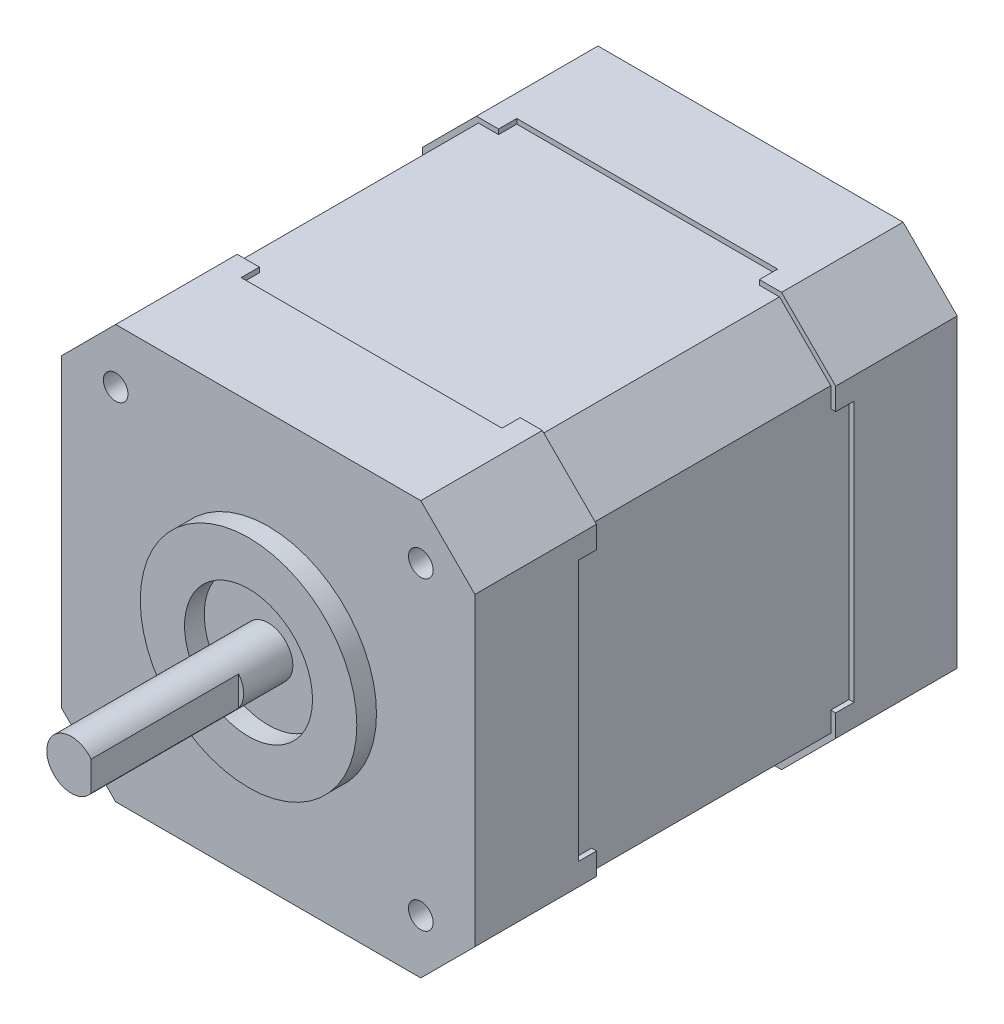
from build123d import *

# Parameters (mm, degrees)
EXTRUDE_1_DEPTH        = 49
SKETCH_2_R             = 11
SKETCH_2_R_2           = 6.5
EXTRUDE_2_DEPTH        = 2
SKETCH_3_R             = 2.5
EXTRUDE_3_DEPTH        = 20
CUT_EXTRUDE_START      = -15
CUT_EXTRUDE_1_DEPTH    = 15
SKETCH_6_W             = 24.3
SKETCH_6_H             = 0.5
SKETCH_7_W             = 26.5
SKETCH_7_H             = 28
CUT_EXTRUDE_2_DEPTH    = 0.5
SKETCH_8_W             = 28
SKETCH_8_H             = 26.5
CUT_EXTRUDE_3_DEPTH    = 0.5
SKETCH_9_W             = 26.5
SKETCH_9_H             = 28
CUT_EXTRUDE_4_DEPTH    = 0.5
SKETCH_10_W            = 28
SKETCH_10_H            = 26.5
CUT_EXTRUDE_5_DEPTH    = 0.5
HOLE_WIZARD_M3_1_D     = 2.5
HOLE_WIZARD_M3_1_DEPTH = 4.5
HOLE_WIZARD_M3_1_TIP   = 0.751075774
EXTRUDE_START          = 15
SKETCH_13_R            = 2.5
EXTRUDE_4_DEPTH        = 15
CHAMFER_1_SIZE         = 0.5


with BuildPart() as part:
    # Sketch 1 → Extrude 1 (new body)
    with BuildSketch(Plane.XY):
        Polygon((-21, 15.5), (-15.5, 21), (15.5, 21), (21, 15.5), (21, -15.5), (15.5, -21), (-15.5, -21), (-21, -15.5), align=None)
    extrude(amount=-EXTRUDE_1_DEPTH)

    # Sketch 2 → Extrude 2 (add)
    with BuildSketch(Plane.XY):
        with Locations(Location((0, 0, 0), (0, 0, 180))):
            Circle(SKETCH_2_R)
        Circle(SKETCH_2_R_2, mode=Mode.SUBTRACT)
    extrude(amount=EXTRUDE_2_DEPTH)

    # Sketch 3 → Extrude 3 (add)
    with BuildSketch(Plane.XY):
        with Locations(Location((0, 0, 0), (0, 0, 180))):
            Circle(SKETCH_3_R)
    extrude(amount=EXTRUDE_3_DEPTH)

    # Sketch 4 → Cut-Extrude 1 (cut)
    with BuildSketch(Plane.XY.offset(20).offset(CUT_EXTRUDE_START)):
        with BuildLine():
            Line((2, 1.5), (2, -1.5))
            ThreePointArc((2, -1.5), (2.5, 0), (2, 1.5))
        make_face()
    extrude(amount=CUT_EXTRUDE_1_DEPTH, mode=Mode.SUBTRACT)

    # Sweep 1: sweep along a path in Sketch 5
    with BuildLine(Plane.XY.offset(-12.35)) as sweep_1_path:
        Line((15.5, 21), (-15.5, 21))
        Line((-15.5, 21), (-21, 15.5))
        Line((-21, 15.5), (-21, -15.5))
        Line((-21, -15.5), (-15.5, -21))
        Line((-15.5, -21), (15.5, -21))
        Line((15.5, -21), (21, -15.5))
        Line((21, -15.5), (21, 15.5))
        Line((21, 15.5), (15.5, 21))
    # Sketch 6 → Sweep 1 (sweep, cut)
    with BuildSketch(Plane(origin=(0, 0, 0), x_dir=(0, 0, -1), z_dir=(1, 0, 0))):
        with Locations((24.5, 20.75)):
            Rectangle(SKETCH_6_W, SKETCH_6_H)
    sweep(path=sweep_1_path.line, transition=Transition.RIGHT, mode=Mode.SUBTRACT)

    # Sketch 7 → Cut-Extrude 2 (cut)
    with BuildSketch(Plane(origin=(0, 21, 0), x_dir=(1, 0, 0), z_dir=(0, 1, 0))):
        with Locations((0, 24.5)):
            Rectangle(SKETCH_7_W, SKETCH_7_H)
    extrude(amount=-CUT_EXTRUDE_2_DEPTH, mode=Mode.SUBTRACT)

    # Sketch 8 → Cut-Extrude 3 (cut)
    with BuildSketch(Plane(origin=(21, 0, 0), x_dir=(0, 0, -1), z_dir=(1, 0, 0))):
        with Locations((24.5, 0)):
            Rectangle(SKETCH_8_W, SKETCH_8_H)
    extrude(amount=-CUT_EXTRUDE_3_DEPTH, mode=Mode.SUBTRACT)

    # Sketch 9 → Cut-Extrude 4 (cut)
    with BuildSketch(Plane.XZ.offset(21)):
        with Locations((0, -24.5)):
            Rectangle(SKETCH_9_W, SKETCH_9_H)
    extrude(amount=-CUT_EXTRUDE_4_DEPTH, mode=Mode.SUBTRACT)

    # Sketch 10 → Cut-Extrude 5 (cut)
    with BuildSketch(Plane.ZY.offset(21)):
        with Locations((-24.5, 0)):
            Rectangle(SKETCH_10_W, SKETCH_10_H)
    extrude(amount=-CUT_EXTRUDE_5_DEPTH, mode=Mode.SUBTRACT)

    # Hole Wizard M3 _1
    with Locations(Plane.XY):
        with Locations((-15.5, 15.5), (15.5, 15.5), (15.5, -15.5), (-15.5, -15.5)):
            Hole(HOLE_WIZARD_M3_1_D / 2, depth=HOLE_WIZARD_M3_1_DEPTH)
            with Locations((0, 0, -(HOLE_WIZARD_M3_1_DEPTH + HOLE_WIZARD_M3_1_TIP / 2))):  # 118° drill point
                Cone(0, HOLE_WIZARD_M3_1_D / 2, HOLE_WIZARD_M3_1_TIP, mode=Mode.SUBTRACT)

    # Sketch 13 → Extrude 4 (add)
    with BuildSketch(Plane(origin=(0, 0, -49), x_dir=(-1, 0, 0), z_dir=(0, 0, -1)).offset(EXTRUDE_START)):
        Circle(SKETCH_13_R)
    extrude(amount=-EXTRUDE_4_DEPTH)

    # Chamfer 1
    chamfer_1_edges = [part.edges().sort_by_distance(p)[0] for p in [
        (2.5, 0, -64),
    ]]
    chamfer(chamfer_1_edges, length=CHAMFER_1_SIZE)


solid = part.part
